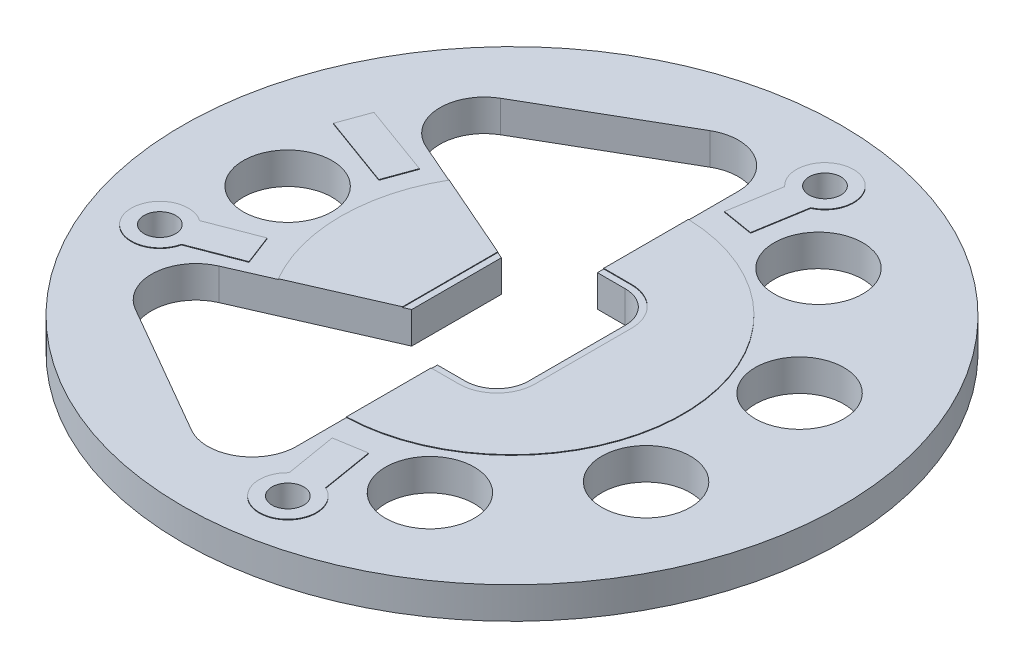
from build123d import *

# Parameters (mm, degrees)
SKETCH1_R                = 6.604
BOSS_EXTRUDE1_DEPTH      = 0.635
CUT_EXTRUDE1_DEPTH       = 10.361028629
CUT_EXTRUDE3_REACH       = 11.361
SKETCH6_R                = 0.889
CIRPATTERN1_COUNT        = 9
BOTTOM_SIDE_GOLD_DEPTH   = 0.0127
GOLD_PLATED_HOLES_REACH  = 11.362
SKETCH8_R                = 0.3175
SKETCH9_R                = 3.429
SKETCH9_R_2              = 0.3175
TOP_SIDE_GOLD_DEPTH      = 0.0127
BACKSIDE_OIL_PORTS_REACH = 11.362


with BuildPart() as part:
    # Sketch1 → Boss-Extrude1 (new body)
    with BuildSketch(Plane(origin=(0, 0, 0), x_dir=(1, 0, 0), z_dir=(0, 1, 0))):
        with Locations(Location((0, 0, 0), (0, 0, 270))):
            Circle(SKETCH1_R)
    extrude(amount=BOSS_EXTRUDE1_DEPTH)

    # Sketch2 → Cut-Extrude1 (cut, through all)
    with BuildSketch(Plane(origin=(0, 0.635, 0), x_dir=(1, 0, 0), z_dir=(0, 1, 0))):
        with BuildLine():
            Line((0.665988, 1.6029051), (-0.477012, 1.6029051))
            ThreePointArc((-0.477012, 1.6029051), (-0.926024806, 1.416917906), (-1.112012, 0.9679051))
            Line((-1.112012, 0.9679051), (-1.112012, -0.9679051))
            ThreePointArc((-1.112012, -0.9679051), (-0.926024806, -1.416917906), (-0.477012, -1.6029051))
            Line((-0.477012, -1.6029051), (0.665988, -1.6029051))
            ThreePointArc((0.665988, -1.6029051), (1.115000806, -1.416917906), (1.300988, -0.9679051))
            Line((1.300988, -0.9679051), (1.300988, 0.9679051))
            ThreePointArc((1.300988, 0.9679051), (1.115000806, 1.416917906), (0.665988, 1.6029051))
        make_face()
    extrude(amount=-CUT_EXTRUDE1_DEPTH, mode=Mode.SUBTRACT)

    # Sketch6 → Cut-Extrude3 (cut, up to next)
    with BuildSketch(Plane(origin=(0, 0.635, 0), x_dir=(1, 0, 0), z_dir=(0, 1, 0)), mode=Mode.PRIVATE) as cut_extrude3_sk1:
        with Locations(Location((-4.4958, 0, 0), (0, 0, 270))):
            Circle(SKETCH6_R)
    cut_extrude3_tool1 = extrude(cut_extrude3_sk1.sketch, amount=-CUT_EXTRUDE3_REACH, mode=Mode.PRIVATE) & part.part
    cut_extrude3 = cut_extrude3_tool1.solids().sort_by_distance((-4.4958, 0.635, 0))[0]
    add(cut_extrude3, mode=Mode.SUBTRACT)

    # CirPattern1: Cut-Extrude3 ×9 about axis
    cirpattern1_axis = Axis((0, 0, 0), (0, 1, 0))
    for i in range(1, CIRPATTERN1_COUNT):
        add(cut_extrude3.rotate(cirpattern1_axis, i * 360 / CIRPATTERN1_COUNT), mode=Mode.SUBTRACT)

    # Sketch4 → bottom side gold (add)
    with BuildSketch(Plane.XZ):
        with BuildLine():
            Line((2.824988, 0.7635113), (2.824988, 2.0335113))
            Line((2.824988, 2.0335113), (0.737382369, 2.9225113))
            Line((0.737382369, 2.9225113), (0.965188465, 4.883792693))
            ThreePointArc((0.965188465, 4.883792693), (0.954397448, 5.891637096), (0.712884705, 4.913098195))
            Line((0.712884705, 4.913098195), (0.463171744, 2.763211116))
            Line((0.463171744, 2.763211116), (2.570988, 1.865604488))
            Line((2.570988, 1.865604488), (2.570988, 1.3985113))
            Line((2.570988, 1.3985113), (1.554988, 1.3985113))
            Line((1.554988, 1.3985113), (1.554988, 0.7635113))
            Line((1.554988, 0.7635113), (2.824988, 0.7635113))
        make_face()
        with BuildLine():
            Line((-1.366012, -0.3119882), (-2.636012, -0.3119882))
            Line((-2.636012, -0.3119882), (-3.279554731, 1.162553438))
            Line((-3.279554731, 1.162553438), (-4.678630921, 1.671775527))
            ThreePointArc((-4.678630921, 1.671775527), (-5.574763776, 2.133091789), (-4.591757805, 1.910457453))
            Line((-4.591757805, 1.910457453), (-3.090328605, 1.363981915))
            Line((-3.090328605, 1.363981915), (-2.636012, 0.3230118))
            Line((-2.636012, 0.3230118), (-1.366012, 0.3230118))
            Line((-1.366012, 0.3230118), (-1.366012, -0.3119882))
        make_face()
        with BuildLine():
            Line((2.570988, -1.3874877), (1.554988, -1.3874877))
            Line((1.554988, -1.3874877), (1.554988, -0.7524877))
            Line((1.554988, -0.7524877), (2.824988, -0.7524877))
            Line((2.824988, -0.7524877), (2.824988, -2.0224877))
            Line((2.824988, -2.0224877), (0.737382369, -2.9114877))
            Line((0.737382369, -2.9114877), (0.965188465, -4.872769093))
            ThreePointArc((0.965188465, -4.872769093), (0.954397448, -5.880613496), (0.712884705, -4.902074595))
            Line((0.712884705, -4.902074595), (0.463171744, -2.752187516))
            Line((0.463171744, -2.752187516), (2.570988, -1.854580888))
            Line((2.570988, -1.854580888), (2.570988, -1.3874877))
        make_face()
    extrude(amount=BOTTOM_SIDE_GOLD_DEPTH)

    # Sketch8 → gold plated holes (cut, up to next)
    with BuildSketch(Plane.XZ.offset(0.0127), mode=Mode.PRIVATE) as gold_plated_holes_sk1:
        with Locations(Location((0.895786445, 5.387029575, 0), (0, 0, 270))):
            Circle(SKETCH8_R)
    gold_plated_holes_tool1 = extrude(gold_plated_holes_sk1.sketch, amount=-GOLD_PLATED_HOLES_REACH, mode=Mode.PRIVATE) & part.part
    # Sketch8 → gold plated holes (cut, up to next)
    with BuildSketch(Plane.XZ.offset(0.0127), mode=Mode.PRIVATE) as gold_plated_holes_sk2:
        with Locations(Location((-5.097399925, 1.959345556, 0), (0, 0, 270))):
            Circle(SKETCH8_R)
    gold_plated_holes_tool2 = extrude(gold_plated_holes_sk2.sketch, amount=-GOLD_PLATED_HOLES_REACH, mode=Mode.PRIVATE) & part.part
    # Sketch8 → gold plated holes (cut, up to next)
    with BuildSketch(Plane.XZ.offset(0.0127), mode=Mode.PRIVATE) as gold_plated_holes_sk3:
        with Locations(Location((0.895786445, -5.376005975, 0), (0, 0, 270))):
            Circle(SKETCH8_R)
    gold_plated_holes_tool3 = extrude(gold_plated_holes_sk3.sketch, amount=-GOLD_PLATED_HOLES_REACH, mode=Mode.PRIVATE) & part.part
    add(gold_plated_holes_tool1.solids().sort_by_distance((0.895786, -0.0127, 5.38703))[0], mode=Mode.SUBTRACT)
    add(gold_plated_holes_tool2.solids().sort_by_distance((-5.0974, -0.0127, 1.959346))[0], mode=Mode.SUBTRACT)
    add(gold_plated_holes_tool3.solids().sort_by_distance((0.895786, -0.0127, -5.376006))[0], mode=Mode.SUBTRACT)

    # Sketch9 → top side gold (add)
    # profile 1 of 5: a face of its own
    with BuildSketch(Plane(origin=(0, 0.635, 0), x_dir=(1, 0, 0), z_dir=(0, 1, 0))):
        with Locations(Location((0, 0, 0), (0, 0, 270))):
            Circle(SKETCH9_R)
        with BuildLine():
            Line((0.665988, 1.7299051), (-0.477012, 1.7299051))
            ThreePointArc((-0.477012, 1.7299051), (-1.015827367, 1.506720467), (-1.239012, 0.9679051))
            Line((-1.239012, 0.9679051), (-1.239012, -0.9679051))
            ThreePointArc((-1.239012, -0.9679051), (-1.015827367, -1.506720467), (-0.477012, -1.7299051))
            Line((-0.477012, -1.7299051), (0.665988, -1.7299051))
            ThreePointArc((0.665988, -1.7299051), (1.204803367, -1.506720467), (1.427988, -0.9679051))
            Line((1.427988, -0.9679051), (1.427988, 0.9679051))
            ThreePointArc((1.427988, 0.9679051), (1.204803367, 1.506720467), (0.665988, 1.7299051))
        make_face(mode=Mode.SUBTRACT)
    # profile 2 of 5: a face of its own
    with BuildSketch(Plane(origin=(0, 0.635, 0), x_dir=(1, 0, 0), z_dir=(0, 1, 0))):
        with BuildLine():
            Line((1.130865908, 4.855093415), (0.958482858, 3.82054739))
            Line((0.958482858, 3.82054739), (0.332118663, 3.924916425))
            Line((0.332118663, 3.924916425), (0.504501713, 4.95946245))
            ThreePointArc((0.504501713, 4.95946245), (0.989718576, 5.939733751), (1.130865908, 4.855093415))
        make_face()
        with Locations(Location((0.895786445, 5.376005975, 0), (0, 0, 90))):
            Circle(SKETCH9_R_2, mode=Mode.SUBTRACT)
    # profile 3 of 5: a face of its own
    with BuildSketch(Plane(origin=(0, 0.635, 0), x_dir=(1, 0, 0), z_dir=(0, 1, 0))):
        with BuildLine():
            Line((-4.539932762, -2.085212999), (-3.560954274, -1.708911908))
            Line((-3.560954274, -1.708911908), (-3.788785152, -1.116190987))
            Line((-3.788785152, -1.116190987), (-4.767763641, -1.492492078))
            ThreePointArc((-4.767763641, -1.492492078), (-5.630848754, -2.164393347), (-4.539932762, -2.085212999))
        make_face()
        with Locations(Location((-5.097399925, -1.959345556, 0), (0, 0, 90))):
            Circle(SKETCH9_R_2, mode=Mode.SUBTRACT)
    # profile 4 of 5: a face of its own
    with BuildSketch(Plane(origin=(0, 0.635, 0), x_dir=(1, 0, 0), z_dir=(0, 1, 0))):
        with BuildLine():
            Line((0.504639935, -4.970356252), (0.332600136, -3.935753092))
            Line((0.332600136, -3.935753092), (0.958998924, -3.831591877))
            Line((0.958998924, -3.831591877), (1.131038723, -4.866195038))
            ThreePointArc((1.131038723, -4.866195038), (0.989531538, -5.950788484), (0.504639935, -4.970356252))
        make_face()
        with Locations(Location((0.895786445, -5.387029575, 0), (0, 0, 90))):
            Circle(SKETCH9_R_2, mode=Mode.SUBTRACT)
    # profile 5 of 5: a face of its own
    with BuildSketch(Plane(origin=(0, 0.635, 0), x_dir=(1, 0, 0), z_dir=(0, 1, 0))):
        Polygon((-4.899632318, 2.133943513), (-3.467540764, 1.612704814), (-3.684723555, 1.016), (-5.116815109, 1.537238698), align=None)
    extrude(amount=TOP_SIDE_GOLD_DEPTH)

    # Sketch12 → backside oil ports (cut, up to next)
    with BuildSketch(Plane.XZ, mode=Mode.PRIVATE) as backside_oil_ports_sk1:
        with BuildLine():
            Line((-3.888482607, 3.65974112), (-1.225187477, 5.19739528))
            ThreePointArc((-1.225187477, 5.19739528), (-0.336187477, 5.19739528), (0.108312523, 4.427498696))
            Line((0.108312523, 4.427498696), (0.108312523, 1.6029051))
            Line((0.108312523, 1.6029051), (-1.112012, 0.898350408))
            Line((-1.112012, 0.898350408), (-3.800539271, 2.075480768))
            ThreePointArc((-3.800539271, 2.075480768), (-4.331616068, 2.840571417), (-3.888482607, 3.65974112))
        make_face()
    backside_oil_ports_tool1 = extrude(backside_oil_ports_sk1.sketch, amount=-BACKSIDE_OIL_PORTS_REACH, mode=Mode.PRIVATE) & part.part
    # Sketch12 → backside oil ports (cut, up to next)
    with BuildSketch(Plane.XZ, mode=Mode.PRIVATE) as backside_oil_ports_sk2:
        with BuildLine():
            Line((-1.112012, -0.898350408), (-3.800539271, -2.075480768))
            ThreePointArc((-3.800539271, -2.075480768), (-4.331616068, -2.840571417), (-3.888482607, -3.65974112))
            Line((-3.888482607, -3.65974112), (-1.225187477, -5.19739528))
            ThreePointArc((-1.225187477, -5.19739528), (-0.336187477, -5.19739528), (0.108312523, -4.427498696))
            Line((0.108312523, -4.427498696), (0.108312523, -1.6029051))
            Line((0.108312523, -1.6029051), (-1.112012, -0.898350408))
        make_face()
    backside_oil_ports_tool2 = extrude(backside_oil_ports_sk2.sketch, amount=-BACKSIDE_OIL_PORTS_REACH, mode=Mode.PRIVATE) & part.part
    add(backside_oil_ports_tool1.solids().sort_by_distance((-1.724192, 0, 3.070124))[0], mode=Mode.SUBTRACT)
    add(backside_oil_ports_tool2.solids().sort_by_distance((-1.724192, 0, -3.070124))[0], mode=Mode.SUBTRACT)


solid = part.part
